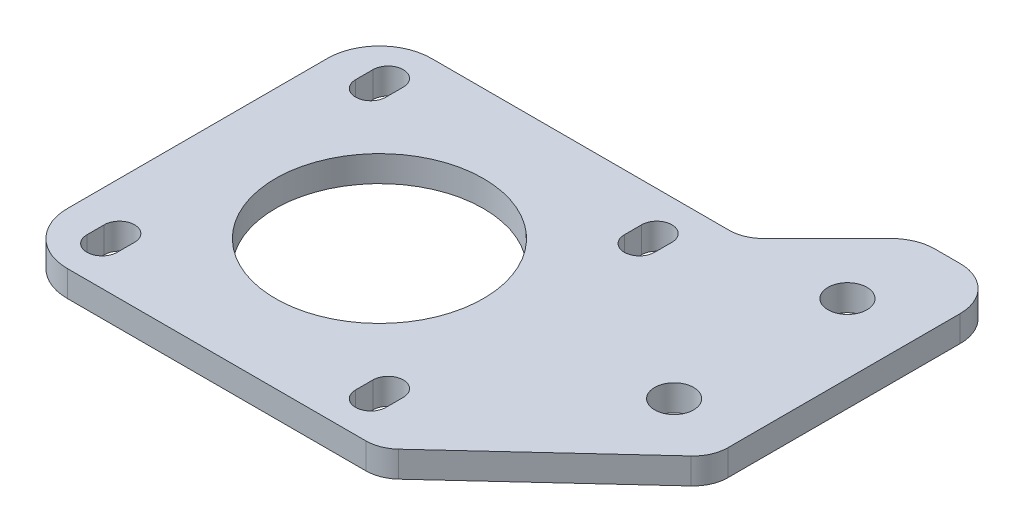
ISO-10303-21;
HEADER;
FILE_DESCRIPTION(('STEP AP214'),'2;1');
FILE_NAME('part.step','',(''),(''),'','','');
FILE_SCHEMA(('AUTOMOTIVE_DESIGN { 1 0 10303 214 1 1 1 1 }'));
ENDSEC;
DATA;
#1=APPLICATION_CONTEXT('core data for automotive mechanical design processes');
#2=APPLICATION_PROTOCOL_DEFINITION('international standard','automotive_design',2000,#1);
#3=PRODUCT_CONTEXT('',#1,'mechanical');
#4=PRODUCT('Part','Part','',(#3));
#5=PRODUCT_RELATED_PRODUCT_CATEGORY('part','',(#4));
#6=PRODUCT_DEFINITION_FORMATION('','',#4);
#7=PRODUCT_DEFINITION_CONTEXT('part definition',#1,'design');
#8=PRODUCT_DEFINITION('design','',#6,#7);
#9=PRODUCT_DEFINITION_SHAPE('','',#8);
#10=(LENGTH_UNIT() NAMED_UNIT(*) SI_UNIT(.MILLI.,.METRE.));
#11=(NAMED_UNIT(*) PLANE_ANGLE_UNIT() SI_UNIT($,.RADIAN.));
#12=(NAMED_UNIT(*) SI_UNIT($,.STERADIAN.) SOLID_ANGLE_UNIT());
#13=UNCERTAINTY_MEASURE_WITH_UNIT(LENGTH_MEASURE(1.E-05),#10,'distance_accuracy_value','');
#14=(GEOMETRIC_REPRESENTATION_CONTEXT(3) GLOBAL_UNCERTAINTY_ASSIGNED_CONTEXT((#13)) GLOBAL_UNIT_ASSIGNED_CONTEXT((#10,
#11,#12)) REPRESENTATION_CONTEXT('',''));
#15=CARTESIAN_POINT('',(0.,0.,0.));
#16=DIRECTION('',(0.,0.,1.));
#17=DIRECTION('',(1.,0.,0.));
#18=AXIS2_PLACEMENT_3D('',#15,#16,#17);
#19=CARTESIAN_POINT('',(-15.0000000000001,1.5,15.));
#20=DIRECTION('',(0.,1.,0.));
#21=DIRECTION('',(0.,0.,1.));
#22=AXIS2_PLACEMENT_3D('',#19,#20,#21);
#23=PLANE('',#22);
#24=CARTESIAN_POINT('',(33.,1.5,-0.999999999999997));
#25=DIRECTION('',(0.,1.,0.));
#26=DIRECTION('',(0.,0.,-1.));
#27=AXIS2_PLACEMENT_3D('',#24,#25,#26);
#28=CIRCLE('',#27,2.25);
#29=CARTESIAN_POINT('',(33.,1.5,-3.25));
#30=VERTEX_POINT('',#29);
#31=EDGE_CURVE('E927',#30,#30,#28,.T.);
#32=ORIENTED_EDGE('',*,*,#31,.F.);
#33=EDGE_LOOP('',(#32));
#34=FACE_BOUND('',#33,.T.);
#35=DIRECTION('',(0.,0.,-1.));
#36=VECTOR('',#35,1.);
#37=CARTESIAN_POINT('',(-13.75,1.5,-16.5000000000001));
#38=LINE('',#37,#36);
#39=CARTESIAN_POINT('',(-13.75,1.5,-14.5));
#40=VERTEX_POINT('',#39);
#41=CARTESIAN_POINT('',(-13.75,1.5,-16.5000000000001));
#42=VERTEX_POINT('',#41);
#43=EDGE_CURVE('E242',#40,#42,#38,.T.);
#44=ORIENTED_EDGE('',*,*,#43,.F.);
#45=CARTESIAN_POINT('',(-15.5000000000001,1.5,-14.5));
#46=DIRECTION('',(0.,1.,0.));
#47=DIRECTION('',(0.,0.,-1.));
#48=AXIS2_PLACEMENT_3D('',#45,#46,#47);
#49=CIRCLE('',#48,1.75000000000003);
#50=CARTESIAN_POINT('',(-17.25,1.5,-14.5));
#51=VERTEX_POINT('',#50);
#52=EDGE_CURVE('E234',#51,#40,#49,.T.);
#53=ORIENTED_EDGE('',*,*,#52,.F.);
#54=DIRECTION('',(0.,0.,1.));
#55=VECTOR('',#54,1.);
#56=CARTESIAN_POINT('',(-17.25,1.5,-14.5));
#57=LINE('',#56,#55);
#58=CARTESIAN_POINT('',(-17.25,1.5,-16.5));
#59=VERTEX_POINT('',#58);
#60=EDGE_CURVE('E257',#59,#51,#57,.T.);
#61=ORIENTED_EDGE('',*,*,#60,.F.);
#62=CARTESIAN_POINT('',(-15.5000000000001,1.5,-16.5000000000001));
#63=DIRECTION('',(0.,1.,0.));
#64=DIRECTION('',(0.,0.,-1.));
#65=AXIS2_PLACEMENT_3D('',#62,#63,#64);
#66=CIRCLE('',#65,1.75);
#67=EDGE_CURVE('E255',#42,#59,#66,.T.);
#68=ORIENTED_EDGE('',*,*,#67,.F.);
#69=EDGE_LOOP('',(#44,#53,#61,#68));
#70=FACE_BOUND('',#69,.T.);
#71=DIRECTION('',(0.,0.,-1.));
#72=VECTOR('',#71,1.);
#73=CARTESIAN_POINT('',(17.25,1.5,-16.5000000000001));
#74=LINE('',#73,#72);
#75=CARTESIAN_POINT('',(17.25,1.5,-14.5));
#76=VERTEX_POINT('',#75);
#77=CARTESIAN_POINT('',(17.25,1.5,-16.5000000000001));
#78=VERTEX_POINT('',#77);
#79=EDGE_CURVE('E275',#76,#78,#74,.T.);
#80=ORIENTED_EDGE('',*,*,#79,.F.);
#81=CARTESIAN_POINT('',(15.5,1.5,-14.5));
#82=DIRECTION('',(0.,1.,0.));
#83=DIRECTION('',(0.,0.,-1.));
#84=AXIS2_PLACEMENT_3D('',#81,#82,#83);
#85=CIRCLE('',#84,1.75);
#86=CARTESIAN_POINT('',(13.75,1.5,-14.5));
#87=VERTEX_POINT('',#86);
#88=EDGE_CURVE('E273',#87,#76,#85,.T.);
#89=ORIENTED_EDGE('',*,*,#88,.F.);
#90=DIRECTION('',(0.,0.,1.));
#91=VECTOR('',#90,1.);
#92=CARTESIAN_POINT('',(13.75,1.5,-14.5));
#93=LINE('',#92,#91);
#94=CARTESIAN_POINT('',(13.75,1.5,-16.5000000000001));
#95=VERTEX_POINT('',#94);
#96=EDGE_CURVE('E281',#95,#87,#93,.T.);
#97=ORIENTED_EDGE('',*,*,#96,.F.);
#98=CARTESIAN_POINT('',(15.5,1.5,-16.5000000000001));
#99=DIRECTION('',(0.,1.,0.));
#100=DIRECTION('',(0.,0.,-1.));
#101=AXIS2_PLACEMENT_3D('',#98,#99,#100);
#102=CIRCLE('',#101,1.75);
#103=EDGE_CURVE('E278',#78,#95,#102,.T.);
#104=ORIENTED_EDGE('',*,*,#103,.F.);
#105=EDGE_LOOP('',(#80,#89,#97,#104));
#106=FACE_BOUND('',#105,.T.);
#107=DIRECTION('',(0.,0.,1.));
#108=VECTOR('',#107,1.);
#109=CARTESIAN_POINT('',(-17.25,1.5,16.5));
#110=LINE('',#109,#108);
#111=CARTESIAN_POINT('',(-17.25,1.5,14.5));
#112=VERTEX_POINT('',#111);
#113=CARTESIAN_POINT('',(-17.2500000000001,1.5,16.5));
#114=VERTEX_POINT('',#113);
#115=EDGE_CURVE('E306',#112,#114,#110,.T.);
#116=ORIENTED_EDGE('',*,*,#115,.F.);
#117=CARTESIAN_POINT('',(-15.5000000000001,1.5,14.5));
#118=DIRECTION('',(0.,1.,0.));
#119=DIRECTION('',(0.,0.,-1.));
#120=AXIS2_PLACEMENT_3D('',#117,#118,#119);
#121=CIRCLE('',#120,1.75);
#122=CARTESIAN_POINT('',(-13.75,1.5,14.5));
#123=VERTEX_POINT('',#122);
#124=EDGE_CURVE('E304',#123,#112,#121,.T.);
#125=ORIENTED_EDGE('',*,*,#124,.F.);
#126=DIRECTION('',(0.,0.,-1.));
#127=VECTOR('',#126,1.);
#128=CARTESIAN_POINT('',(-13.75,1.5,14.5));
#129=LINE('',#128,#127);
#130=CARTESIAN_POINT('',(-13.75,1.5,16.5));
#131=VERTEX_POINT('',#130);
#132=EDGE_CURVE('E312',#131,#123,#129,.T.);
#133=ORIENTED_EDGE('',*,*,#132,.F.);
#134=CARTESIAN_POINT('',(-15.5000000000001,1.5,16.5));
#135=DIRECTION('',(0.,1.,0.));
#136=DIRECTION('',(0.,0.,-1.));
#137=AXIS2_PLACEMENT_3D('',#134,#135,#136);
#138=CIRCLE('',#137,1.75000000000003);
#139=EDGE_CURVE('E309',#114,#131,#138,.T.);
#140=ORIENTED_EDGE('',*,*,#139,.F.);
#141=EDGE_LOOP('',(#116,#125,#133,#140));
#142=FACE_BOUND('',#141,.T.);
#143=DIRECTION('',(0.,0.,1.));
#144=VECTOR('',#143,1.);
#145=CARTESIAN_POINT('',(13.75,1.5,16.5));
#146=LINE('',#145,#144);
#147=CARTESIAN_POINT('',(13.75,1.5,14.5));
#148=VERTEX_POINT('',#147);
#149=CARTESIAN_POINT('',(13.75,1.5,16.5));
#150=VERTEX_POINT('',#149);
#151=EDGE_CURVE('E337',#148,#150,#146,.T.);
#152=ORIENTED_EDGE('',*,*,#151,.F.);
#153=CARTESIAN_POINT('',(15.5,1.5,14.5));
#154=DIRECTION('',(0.,1.,0.));
#155=DIRECTION('',(0.,0.,-1.));
#156=AXIS2_PLACEMENT_3D('',#153,#154,#155);
#157=CIRCLE('',#156,1.75);
#158=CARTESIAN_POINT('',(17.25,1.5,14.5));
#159=VERTEX_POINT('',#158);
#160=EDGE_CURVE('E335',#159,#148,#157,.T.);
#161=ORIENTED_EDGE('',*,*,#160,.F.);
#162=DIRECTION('',(0.,0.,-1.));
#163=VECTOR('',#162,1.);
#164=CARTESIAN_POINT('',(17.25,1.5,14.5));
#165=LINE('',#164,#163);
#166=CARTESIAN_POINT('',(17.25,1.5,16.5));
#167=VERTEX_POINT('',#166);
#168=EDGE_CURVE('E343',#167,#159,#165,.T.);
#169=ORIENTED_EDGE('',*,*,#168,.F.);
#170=CARTESIAN_POINT('',(15.5,1.5,16.5));
#171=DIRECTION('',(0.,1.,0.));
#172=DIRECTION('',(0.,0.,-1.));
#173=AXIS2_PLACEMENT_3D('',#170,#171,#172);
#174=CIRCLE('',#173,1.75);
#175=EDGE_CURVE('E340',#150,#167,#174,.T.);
#176=ORIENTED_EDGE('',*,*,#175,.F.);
#177=EDGE_LOOP('',(#152,#161,#169,#176));
#178=FACE_BOUND('',#177,.T.);
#179=CARTESIAN_POINT('',(-15.0000000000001,1.5,15.));
#180=DIRECTION('',(0.,1.,0.));
#181=DIRECTION('',(0.,0.,1.));
#182=AXIS2_PLACEMENT_3D('',#179,#180,#181);
#183=CIRCLE('',#182,5.99999999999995);
#184=CARTESIAN_POINT('',(-21.,1.5,15.));
#185=VERTEX_POINT('',#184);
#186=CARTESIAN_POINT('',(-15.0000000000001,1.5,21.));
#187=VERTEX_POINT('',#186);
#188=EDGE_CURVE('E366',#185,#187,#183,.T.);
#189=ORIENTED_EDGE('',*,*,#188,.T.);
#190=DIRECTION('',(1.,0.,0.));
#191=VECTOR('',#190,1.);
#192=CARTESIAN_POINT('',(-15.0000000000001,1.5,21.));
#193=LINE('',#192,#191);
#194=CARTESIAN_POINT('',(19.4367830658,1.5,21.));
#195=VERTEX_POINT('',#194);
#196=EDGE_CURVE('E369',#187,#195,#193,.T.);
#197=ORIENTED_EDGE('',*,*,#196,.T.);
#198=CARTESIAN_POINT('',(19.4367830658,1.5,16.9999999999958));
#199=DIRECTION('',(0.,1.,0.));
#200=DIRECTION('',(0.,0.,1.));
#201=AXIS2_PLACEMENT_3D('',#198,#199,#200);
#202=CIRCLE('',#201,4.00000000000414);
#203=CARTESIAN_POINT('',(22.1489875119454,1.5,19.9400590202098));
#204=VERTEX_POINT('',#203);
#205=EDGE_CURVE('E372',#195,#204,#202,.T.);
#206=ORIENTED_EDGE('',*,*,#205,.T.);
#207=DIRECTION('',(0.735014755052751,0.,-0.678051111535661));
#208=VECTOR('',#207,1.);
#209=CARTESIAN_POINT('',(22.1489875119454,1.5,19.9400590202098));
#210=LINE('',#209,#208);
#211=CARTESIAN_POINT('',(39.7122044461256,1.5,3.73799139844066));
#212=VERTEX_POINT('',#211);
#213=EDGE_CURVE('E374',#204,#212,#210,.T.);
#214=ORIENTED_EDGE('',*,*,#213,.T.);
#215=CARTESIAN_POINT('',(36.999999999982,1.5,0.797932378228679));
#216=DIRECTION('',(0.,1.,0.));
#217=DIRECTION('',(0.,0.,1.));
#218=AXIS2_PLACEMENT_3D('',#215,#216,#217);
#219=CIRCLE('',#218,4.00000000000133);
#220=CARTESIAN_POINT('',(40.9999999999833,1.5,0.797932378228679));
#221=VERTEX_POINT('',#220);
#222=EDGE_CURVE('E376',#212,#221,#219,.T.);
#223=ORIENTED_EDGE('',*,*,#222,.T.);
#224=DIRECTION('',(0.,0.,-1.));
#225=VECTOR('',#224,1.);
#226=CARTESIAN_POINT('',(40.9999999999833,1.5,0.797932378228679));
#227=LINE('',#226,#225);
#228=CARTESIAN_POINT('',(40.9999999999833,1.5,-26.0000000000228));
#229=VERTEX_POINT('',#228);
#230=EDGE_CURVE('E378',#221,#229,#227,.T.);
#231=ORIENTED_EDGE('',*,*,#230,.T.);
#232=CARTESIAN_POINT('',(35.9999999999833,1.5,-26.0000000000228));
#233=DIRECTION('',(0.,1.,0.));
#234=DIRECTION('',(0.,0.,1.));
#235=AXIS2_PLACEMENT_3D('',#232,#233,#234);
#236=CIRCLE('',#235,5.);
#237=CARTESIAN_POINT('',(35.9999999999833,1.5,-31.0000000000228));
#238=VERTEX_POINT('',#237);
#239=EDGE_CURVE('E380',#229,#238,#236,.T.);
#240=ORIENTED_EDGE('',*,*,#239,.T.);
#241=DIRECTION('',(-1.,0.,0.));
#242=VECTOR('',#241,1.);
#243=CARTESIAN_POINT('',(35.9999999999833,1.5,-31.0000000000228));
#244=LINE('',#243,#242);
#245=CARTESIAN_POINT('',(33.0710678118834,1.5,-31.0000000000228));
#246=VERTEX_POINT('',#245);
#247=EDGE_CURVE('E382',#238,#246,#244,.T.);
#248=ORIENTED_EDGE('',*,*,#247,.T.);
#249=CARTESIAN_POINT('',(33.0710678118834,1.5,-26.0000000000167));
#250=DIRECTION('',(0.,1.,0.));
#251=DIRECTION('',(0.,0.,1.));
#252=AXIS2_PLACEMENT_3D('',#249,#250,#251);
#253=CIRCLE('',#252,5.00000000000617);
#254=CARTESIAN_POINT('',(29.5355339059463,1.5,-29.5355339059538));
#255=VERTEX_POINT('',#254);
#256=EDGE_CURVE('E384',#246,#255,#253,.T.);
#257=ORIENTED_EDGE('',*,*,#256,.T.);
#258=DIRECTION('',(-0.707106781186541,0.,0.707106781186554));
#259=VECTOR('',#258,1.);
#260=CARTESIAN_POINT('',(29.5355339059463,1.5,-29.5355339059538));
#261=LINE('',#260,#259);
#262=CARTESIAN_POINT('',(22.1715728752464,1.5,-22.1715728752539));
#263=VERTEX_POINT('',#262);
#264=EDGE_CURVE('E386',#255,#263,#261,.T.);
#265=ORIENTED_EDGE('',*,*,#264,.T.);
#266=CARTESIAN_POINT('',(19.3431457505,1.5,-25.));
#267=DIRECTION('',(0.,-1.,0.));
#268=DIRECTION('',(0.,0.,-1.));
#269=AXIS2_PLACEMENT_3D('',#266,#267,#268);
#270=CIRCLE('',#269,4.00000000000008);
#271=CARTESIAN_POINT('',(19.3431457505,1.5,-21.));
#272=VERTEX_POINT('',#271);
#273=EDGE_CURVE('E388',#263,#272,#270,.T.);
#274=ORIENTED_EDGE('',*,*,#273,.T.);
#275=DIRECTION('',(-1.,0.,0.));
#276=VECTOR('',#275,1.);
#277=CARTESIAN_POINT('',(19.3431457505,1.5,-21.));
#278=LINE('',#277,#276);
#279=CARTESIAN_POINT('',(-15.0000000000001,1.5,-20.9999999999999));
#280=VERTEX_POINT('',#279);
#281=EDGE_CURVE('E390',#272,#280,#278,.T.);
#282=ORIENTED_EDGE('',*,*,#281,.T.);
#283=CARTESIAN_POINT('',(-15.0000000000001,1.5,-14.9999999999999));
#284=DIRECTION('',(0.,1.,0.));
#285=DIRECTION('',(0.,0.,1.));
#286=AXIS2_PLACEMENT_3D('',#283,#284,#285);
#287=CIRCLE('',#286,6.);
#288=CARTESIAN_POINT('',(-21.,1.5,-15.));
#289=VERTEX_POINT('',#288);
#290=EDGE_CURVE('E392',#280,#289,#287,.T.);
#291=ORIENTED_EDGE('',*,*,#290,.T.);
#292=DIRECTION('',(0.,0.,1.));
#293=VECTOR('',#292,1.);
#294=CARTESIAN_POINT('',(-21.,1.5,-15.));
#295=LINE('',#294,#293);
#296=EDGE_CURVE('E394',#289,#185,#295,.T.);
#297=ORIENTED_EDGE('',*,*,#296,.T.);
#298=EDGE_LOOP('',(#189,#197,#206,#214,#223,#231,#240,#248,#257,#265,#274,#282,#291,#297));
#299=FACE_BOUND('',#298,.T.);
#300=CARTESIAN_POINT('',(0.,1.5,0.));
#301=DIRECTION('',(0.,1.,0.));
#302=DIRECTION('',(0.,0.,-1.));
#303=AXIS2_PLACEMENT_3D('',#300,#301,#302);
#304=CIRCLE('',#303,12.);
#305=CARTESIAN_POINT('',(0.,1.5,-12.));
#306=VERTEX_POINT('',#305);
#307=EDGE_CURVE('E263',#306,#306,#304,.T.);
#308=ORIENTED_EDGE('',*,*,#307,.F.);
#309=EDGE_LOOP('',(#308));
#310=FACE_BOUND('',#309,.T.);
#311=CARTESIAN_POINT('',(33.,1.5,-21.));
#312=DIRECTION('',(0.,1.,0.));
#313=DIRECTION('',(0.,0.,-1.));
#314=AXIS2_PLACEMENT_3D('',#311,#312,#313);
#315=CIRCLE('',#314,2.25);
#316=CARTESIAN_POINT('',(33.,1.5,-23.25));
#317=VERTEX_POINT('',#316);
#318=EDGE_CURVE('E918',#317,#317,#315,.T.);
#319=ORIENTED_EDGE('',*,*,#318,.F.);
#320=EDGE_LOOP('',(#319));
#321=FACE_BOUND('',#320,.T.);
#322=ADVANCED_FACE('F37',(#34,#70,#106,#142,#178,#299,#310,#321),#23,.T.);
#323=CARTESIAN_POINT('',(-15.0000000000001,-1.5,15.));
#324=DIRECTION('',(0.,1.,0.));
#325=DIRECTION('',(0.,0.,1.));
#326=AXIS2_PLACEMENT_3D('',#323,#324,#325);
#327=PLANE('',#326);
#328=CARTESIAN_POINT('',(15.5,-1.5,-14.5));
#329=DIRECTION('',(0.,1.,0.));
#330=DIRECTION('',(0.,0.,-1.));
#331=AXIS2_PLACEMENT_3D('',#328,#329,#330);
#332=CIRCLE('',#331,1.75);
#333=CARTESIAN_POINT('',(13.75,-1.5,-14.5));
#334=VERTEX_POINT('',#333);
#335=CARTESIAN_POINT('',(17.25,-1.5,-14.5));
#336=VERTEX_POINT('',#335);
#337=EDGE_CURVE('E250',#334,#336,#332,.T.);
#338=ORIENTED_EDGE('',*,*,#337,.T.);
#339=DIRECTION('',(0.,0.,-1.));
#340=VECTOR('',#339,1.);
#341=CARTESIAN_POINT('',(17.25,-1.5,-16.5000000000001));
#342=LINE('',#341,#340);
#343=CARTESIAN_POINT('',(17.25,-1.5,-16.5000000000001));
#344=VERTEX_POINT('',#343);
#345=EDGE_CURVE('E286',#336,#344,#342,.T.);
#346=ORIENTED_EDGE('',*,*,#345,.T.);
#347=CARTESIAN_POINT('',(15.5,-1.5,-16.5000000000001));
#348=DIRECTION('',(0.,1.,0.));
#349=DIRECTION('',(0.,0.,-1.));
#350=AXIS2_PLACEMENT_3D('',#347,#348,#349);
#351=CIRCLE('',#350,1.75);
#352=CARTESIAN_POINT('',(13.75,-1.5,-16.5000000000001));
#353=VERTEX_POINT('',#352);
#354=EDGE_CURVE('E289',#344,#353,#351,.T.);
#355=ORIENTED_EDGE('',*,*,#354,.T.);
#356=DIRECTION('',(0.,0.,1.));
#357=VECTOR('',#356,1.);
#358=CARTESIAN_POINT('',(13.75,-1.5,-14.5));
#359=LINE('',#358,#357);
#360=EDGE_CURVE('E276',#353,#334,#359,.T.);
#361=ORIENTED_EDGE('',*,*,#360,.T.);
#362=EDGE_LOOP('',(#338,#346,#355,#361));
#363=FACE_BOUND('',#362,.T.);
#364=CARTESIAN_POINT('',(15.5,-1.5,14.5));
#365=DIRECTION('',(0.,1.,0.));
#366=DIRECTION('',(0.,0.,-1.));
#367=AXIS2_PLACEMENT_3D('',#364,#365,#366);
#368=CIRCLE('',#367,1.75);
#369=CARTESIAN_POINT('',(17.25,-1.5,14.5));
#370=VERTEX_POINT('',#369);
#371=CARTESIAN_POINT('',(13.75,-1.5,14.5));
#372=VERTEX_POINT('',#371);
#373=EDGE_CURVE('E334',#370,#372,#368,.T.);
#374=ORIENTED_EDGE('',*,*,#373,.T.);
#375=DIRECTION('',(0.,0.,1.));
#376=VECTOR('',#375,1.);
#377=CARTESIAN_POINT('',(13.75,-1.5,16.5));
#378=LINE('',#377,#376);
#379=CARTESIAN_POINT('',(13.75,-1.5,16.5));
#380=VERTEX_POINT('',#379);
#381=EDGE_CURVE('E348',#372,#380,#378,.T.);
#382=ORIENTED_EDGE('',*,*,#381,.T.);
#383=CARTESIAN_POINT('',(15.5,-1.5,16.5));
#384=DIRECTION('',(0.,1.,0.));
#385=DIRECTION('',(0.,0.,-1.));
#386=AXIS2_PLACEMENT_3D('',#383,#384,#385);
#387=CIRCLE('',#386,1.75);
#388=CARTESIAN_POINT('',(17.25,-1.5,16.5));
#389=VERTEX_POINT('',#388);
#390=EDGE_CURVE('E351',#380,#389,#387,.T.);
#391=ORIENTED_EDGE('',*,*,#390,.T.);
#392=DIRECTION('',(0.,0.,-1.));
#393=VECTOR('',#392,1.);
#394=CARTESIAN_POINT('',(17.25,-1.5,14.5));
#395=LINE('',#394,#393);
#396=EDGE_CURVE('E338',#389,#370,#395,.T.);
#397=ORIENTED_EDGE('',*,*,#396,.T.);
#398=EDGE_LOOP('',(#374,#382,#391,#397));
#399=FACE_BOUND('',#398,.T.);
#400=CARTESIAN_POINT('',(-15.0000000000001,-1.5,15.));
#401=DIRECTION('',(0.,1.,0.));
#402=DIRECTION('',(0.,0.,1.));
#403=AXIS2_PLACEMENT_3D('',#400,#401,#402);
#404=CIRCLE('',#403,5.99999999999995);
#405=CARTESIAN_POINT('',(-21.,-1.5,15.));
#406=VERTEX_POINT('',#405);
#407=CARTESIAN_POINT('',(-15.0000000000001,-1.5,21.));
#408=VERTEX_POINT('',#407);
#409=EDGE_CURVE('E365',#406,#408,#404,.T.);
#410=ORIENTED_EDGE('',*,*,#409,.F.);
#411=DIRECTION('',(0.,0.,1.));
#412=VECTOR('',#411,1.);
#413=CARTESIAN_POINT('',(-21.,-1.5,-15.));
#414=LINE('',#413,#412);
#415=CARTESIAN_POINT('',(-21.,-1.5,-15.));
#416=VERTEX_POINT('',#415);
#417=EDGE_CURVE('E370',#416,#406,#414,.T.);
#418=ORIENTED_EDGE('',*,*,#417,.F.);
#419=CARTESIAN_POINT('',(-15.0000000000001,-1.5,-14.9999999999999));
#420=DIRECTION('',(0.,1.,0.));
#421=DIRECTION('',(0.,0.,1.));
#422=AXIS2_PLACEMENT_3D('',#419,#420,#421);
#423=CIRCLE('',#422,6.);
#424=CARTESIAN_POINT('',(-15.0000000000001,-1.5,-20.9999999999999));
#425=VERTEX_POINT('',#424);
#426=EDGE_CURVE('E421',#425,#416,#423,.T.);
#427=ORIENTED_EDGE('',*,*,#426,.F.);
#428=DIRECTION('',(-1.,0.,0.));
#429=VECTOR('',#428,1.);
#430=CARTESIAN_POINT('',(19.3431457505,-1.5,-21.));
#431=LINE('',#430,#429);
#432=CARTESIAN_POINT('',(19.3431457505,-1.5,-21.));
#433=VERTEX_POINT('',#432);
#434=EDGE_CURVE('E419',#433,#425,#431,.T.);
#435=ORIENTED_EDGE('',*,*,#434,.F.);
#436=CARTESIAN_POINT('',(19.3431457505,-1.5,-25.));
#437=DIRECTION('',(0.,-1.,0.));
#438=DIRECTION('',(0.,0.,-1.));
#439=AXIS2_PLACEMENT_3D('',#436,#437,#438);
#440=CIRCLE('',#439,4.00000000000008);
#441=CARTESIAN_POINT('',(22.1715728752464,-1.5,-22.1715728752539));
#442=VERTEX_POINT('',#441);
#443=EDGE_CURVE('E417',#442,#433,#440,.T.);
#444=ORIENTED_EDGE('',*,*,#443,.F.);
#445=DIRECTION('',(-0.707106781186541,0.,0.707106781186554));
#446=VECTOR('',#445,1.);
#447=CARTESIAN_POINT('',(29.5355339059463,-1.5,-29.5355339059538));
#448=LINE('',#447,#446);
#449=CARTESIAN_POINT('',(29.5355339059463,-1.5,-29.5355339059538));
#450=VERTEX_POINT('',#449);
#451=EDGE_CURVE('E415',#450,#442,#448,.T.);
#452=ORIENTED_EDGE('',*,*,#451,.F.);
#453=CARTESIAN_POINT('',(33.0710678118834,-1.5,-26.0000000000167));
#454=DIRECTION('',(0.,1.,0.));
#455=DIRECTION('',(0.,0.,1.));
#456=AXIS2_PLACEMENT_3D('',#453,#454,#455);
#457=CIRCLE('',#456,5.00000000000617);
#458=CARTESIAN_POINT('',(33.0710678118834,-1.5,-31.0000000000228));
#459=VERTEX_POINT('',#458);
#460=EDGE_CURVE('E413',#459,#450,#457,.T.);
#461=ORIENTED_EDGE('',*,*,#460,.F.);
#462=DIRECTION('',(-1.,0.,0.));
#463=VECTOR('',#462,1.);
#464=CARTESIAN_POINT('',(35.9999999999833,-1.5,-31.0000000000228));
#465=LINE('',#464,#463);
#466=CARTESIAN_POINT('',(35.9999999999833,-1.5,-31.0000000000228));
#467=VERTEX_POINT('',#466);
#468=EDGE_CURVE('E411',#467,#459,#465,.T.);
#469=ORIENTED_EDGE('',*,*,#468,.F.);
#470=CARTESIAN_POINT('',(35.9999999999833,-1.5,-26.0000000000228));
#471=DIRECTION('',(0.,1.,0.));
#472=DIRECTION('',(0.,0.,1.));
#473=AXIS2_PLACEMENT_3D('',#470,#471,#472);
#474=CIRCLE('',#473,5.);
#475=CARTESIAN_POINT('',(40.9999999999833,-1.5,-26.0000000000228));
#476=VERTEX_POINT('',#475);
#477=EDGE_CURVE('E409',#476,#467,#474,.T.);
#478=ORIENTED_EDGE('',*,*,#477,.F.);
#479=DIRECTION('',(0.,0.,-1.));
#480=VECTOR('',#479,1.);
#481=CARTESIAN_POINT('',(40.9999999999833,-1.5,0.797932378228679));
#482=LINE('',#481,#480);
#483=CARTESIAN_POINT('',(40.9999999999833,-1.5,0.797932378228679));
#484=VERTEX_POINT('',#483);
#485=EDGE_CURVE('E407',#484,#476,#482,.T.);
#486=ORIENTED_EDGE('',*,*,#485,.F.);
#487=CARTESIAN_POINT('',(36.999999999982,-1.5,0.797932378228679));
#488=DIRECTION('',(0.,1.,0.));
#489=DIRECTION('',(0.,0.,1.));
#490=AXIS2_PLACEMENT_3D('',#487,#488,#489);
#491=CIRCLE('',#490,4.00000000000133);
#492=CARTESIAN_POINT('',(39.7122044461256,-1.5,3.73799139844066));
#493=VERTEX_POINT('',#492);
#494=EDGE_CURVE('E405',#493,#484,#491,.T.);
#495=ORIENTED_EDGE('',*,*,#494,.F.);
#496=DIRECTION('',(0.735014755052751,0.,-0.678051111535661));
#497=VECTOR('',#496,1.);
#498=CARTESIAN_POINT('',(22.1489875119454,-1.5,19.9400590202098));
#499=LINE('',#498,#497);
#500=CARTESIAN_POINT('',(22.1489875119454,-1.5,19.9400590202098));
#501=VERTEX_POINT('',#500);
#502=EDGE_CURVE('E403',#501,#493,#499,.T.);
#503=ORIENTED_EDGE('',*,*,#502,.F.);
#504=CARTESIAN_POINT('',(19.4367830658,-1.5,16.9999999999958));
#505=DIRECTION('',(0.,1.,0.));
#506=DIRECTION('',(0.,0.,1.));
#507=AXIS2_PLACEMENT_3D('',#504,#505,#506);
#508=CIRCLE('',#507,4.00000000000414);
#509=CARTESIAN_POINT('',(19.4367830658,-1.5,21.));
#510=VERTEX_POINT('',#509);
#511=EDGE_CURVE('E401',#510,#501,#508,.T.);
#512=ORIENTED_EDGE('',*,*,#511,.F.);
#513=DIRECTION('',(1.,0.,0.));
#514=VECTOR('',#513,1.);
#515=CARTESIAN_POINT('',(-15.0000000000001,-1.5,21.));
#516=LINE('',#515,#514);
#517=EDGE_CURVE('E399',#408,#510,#516,.T.);
#518=ORIENTED_EDGE('',*,*,#517,.F.);
#519=EDGE_LOOP('',(#410,#418,#427,#435,#444,#452,#461,#469,#478,#486,#495,#503,#512,#518));
#520=FACE_BOUND('',#519,.T.);
#521=CARTESIAN_POINT('',(-15.5000000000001,-1.5,14.5));
#522=DIRECTION('',(0.,1.,0.));
#523=DIRECTION('',(0.,0.,-1.));
#524=AXIS2_PLACEMENT_3D('',#521,#522,#523);
#525=CIRCLE('',#524,1.75);
#526=CARTESIAN_POINT('',(-13.75,-1.5,14.5));
#527=VERTEX_POINT('',#526);
#528=CARTESIAN_POINT('',(-17.25,-1.5,14.5));
#529=VERTEX_POINT('',#528);
#530=EDGE_CURVE('E303',#527,#529,#525,.T.);
#531=ORIENTED_EDGE('',*,*,#530,.T.);
#532=DIRECTION('',(0.,0.,1.));
#533=VECTOR('',#532,1.);
#534=CARTESIAN_POINT('',(-17.25,-1.5,16.5));
#535=LINE('',#534,#533);
#536=CARTESIAN_POINT('',(-17.2500000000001,-1.5,16.5));
#537=VERTEX_POINT('',#536);
#538=EDGE_CURVE('E317',#529,#537,#535,.T.);
#539=ORIENTED_EDGE('',*,*,#538,.T.);
#540=CARTESIAN_POINT('',(-15.5000000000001,-1.5,16.5));
#541=DIRECTION('',(0.,1.,0.));
#542=DIRECTION('',(0.,0.,-1.));
#543=AXIS2_PLACEMENT_3D('',#540,#541,#542);
#544=CIRCLE('',#543,1.75000000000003);
#545=CARTESIAN_POINT('',(-13.75,-1.5,16.5));
#546=VERTEX_POINT('',#545);
#547=EDGE_CURVE('E320',#537,#546,#544,.T.);
#548=ORIENTED_EDGE('',*,*,#547,.T.);
#549=DIRECTION('',(0.,0.,-1.));
#550=VECTOR('',#549,1.);
#551=CARTESIAN_POINT('',(-13.75,-1.5,14.5));
#552=LINE('',#551,#550);
#553=EDGE_CURVE('E307',#546,#527,#552,.T.);
#554=ORIENTED_EDGE('',*,*,#553,.T.);
#555=EDGE_LOOP('',(#531,#539,#548,#554));
#556=FACE_BOUND('',#555,.T.);
#557=CARTESIAN_POINT('',(-15.5000000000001,-1.5,-14.5));
#558=DIRECTION('',(0.,1.,0.));
#559=DIRECTION('',(0.,0.,-1.));
#560=AXIS2_PLACEMENT_3D('',#557,#558,#559);
#561=CIRCLE('',#560,1.75000000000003);
#562=CARTESIAN_POINT('',(-17.25,-1.5,-14.5));
#563=VERTEX_POINT('',#562);
#564=CARTESIAN_POINT('',(-13.75,-1.5,-14.5));
#565=VERTEX_POINT('',#564);
#566=EDGE_CURVE('E60',#563,#565,#561,.T.);
#567=ORIENTED_EDGE('',*,*,#566,.T.);
#568=DIRECTION('',(0.,0.,-1.));
#569=VECTOR('',#568,1.);
#570=CARTESIAN_POINT('',(-13.75,-1.5,-16.5000000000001));
#571=LINE('',#570,#569);
#572=CARTESIAN_POINT('',(-13.75,-1.5,-16.5000000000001));
#573=VERTEX_POINT('',#572);
#574=EDGE_CURVE('E249',#565,#573,#571,.T.);
#575=ORIENTED_EDGE('',*,*,#574,.T.);
#576=CARTESIAN_POINT('',(-15.5000000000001,-1.5,-16.5000000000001));
#577=DIRECTION('',(0.,1.,0.));
#578=DIRECTION('',(0.,0.,-1.));
#579=AXIS2_PLACEMENT_3D('',#576,#577,#578);
#580=CIRCLE('',#579,1.75);
#581=CARTESIAN_POINT('',(-17.2500000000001,-1.5,-16.5000000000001));
#582=VERTEX_POINT('',#581);
#583=EDGE_CURVE('E265',#573,#582,#580,.T.);
#584=ORIENTED_EDGE('',*,*,#583,.T.);
#585=DIRECTION('',(0.,0.,1.));
#586=VECTOR('',#585,1.);
#587=CARTESIAN_POINT('',(-17.25,-1.5,-14.5));
#588=LINE('',#587,#586);
#589=EDGE_CURVE('E243',#582,#563,#588,.T.);
#590=ORIENTED_EDGE('',*,*,#589,.T.);
#591=EDGE_LOOP('',(#567,#575,#584,#590));
#592=FACE_BOUND('',#591,.T.);
#593=CARTESIAN_POINT('',(0.,-1.5,0.));
#594=DIRECTION('',(0.,1.,0.));
#595=DIRECTION('',(0.,0.,-1.));
#596=AXIS2_PLACEMENT_3D('',#593,#594,#595);
#597=CIRCLE('',#596,12.);
#598=CARTESIAN_POINT('',(0.,-1.5,-12.));
#599=VERTEX_POINT('',#598);
#600=EDGE_CURVE('E930',#599,#599,#597,.T.);
#601=ORIENTED_EDGE('',*,*,#600,.T.);
#602=EDGE_LOOP('',(#601));
#603=FACE_BOUND('',#602,.T.);
#604=CARTESIAN_POINT('',(33.,-1.5,-0.999999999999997));
#605=DIRECTION('',(0.,1.,0.));
#606=DIRECTION('',(0.,0.,-1.));
#607=AXIS2_PLACEMENT_3D('',#604,#605,#606);
#608=CIRCLE('',#607,2.25);
#609=CARTESIAN_POINT('',(33.,-1.5,-3.25));
#610=VERTEX_POINT('',#609);
#611=EDGE_CURVE('E924',#610,#610,#608,.T.);
#612=ORIENTED_EDGE('',*,*,#611,.T.);
#613=EDGE_LOOP('',(#612));
#614=FACE_BOUND('',#613,.T.);
#615=CARTESIAN_POINT('',(33.,-1.5,-21.));
#616=DIRECTION('',(0.,1.,0.));
#617=DIRECTION('',(0.,0.,-1.));
#618=AXIS2_PLACEMENT_3D('',#615,#616,#617);
#619=CIRCLE('',#618,2.25);
#620=CARTESIAN_POINT('',(33.,-1.5,-23.25));
#621=VERTEX_POINT('',#620);
#622=EDGE_CURVE('E921',#621,#621,#619,.T.);
#623=ORIENTED_EDGE('',*,*,#622,.T.);
#624=EDGE_LOOP('',(#623));
#625=FACE_BOUND('',#624,.T.);
#626=ADVANCED_FACE('F469',(#363,#399,#520,#556,#592,#603,#614,#625),#327,.F.);
#627=CARTESIAN_POINT('',(-15.0000000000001,1.5,15.));
#628=DIRECTION('',(0.,-1.,0.));
#629=DIRECTION('',(0.,0.,-1.));
#630=AXIS2_PLACEMENT_3D('',#627,#628,#629);
#631=CYLINDRICAL_SURFACE('',#630,5.99999999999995);
#632=ORIENTED_EDGE('',*,*,#409,.T.);
#633=DIRECTION('',(0.,-1.,0.));
#634=VECTOR('',#633,1.);
#635=CARTESIAN_POINT('',(-15.0000000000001,1.5,21.));
#636=LINE('',#635,#634);
#637=EDGE_CURVE('E11',#187,#408,#636,.T.);
#638=ORIENTED_EDGE('',*,*,#637,.F.);
#639=ORIENTED_EDGE('',*,*,#188,.F.);
#640=DIRECTION('',(0.,-1.,0.));
#641=VECTOR('',#640,1.);
#642=CARTESIAN_POINT('',(-21.,1.5,15.));
#643=LINE('',#642,#641);
#644=EDGE_CURVE('E396',#185,#406,#643,.T.);
#645=ORIENTED_EDGE('',*,*,#644,.T.);
#646=EDGE_LOOP('',(#632,#638,#639,#645));
#647=FACE_BOUND('',#646,.T.);
#648=ADVANCED_FACE('F39',(#647),#631,.T.);
#649=CARTESIAN_POINT('',(-15.0000000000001,1.5,21.));
#650=DIRECTION('',(0.,0.,-1.));
#651=DIRECTION('',(-1.,0.,0.));
#652=AXIS2_PLACEMENT_3D('',#649,#650,#651);
#653=PLANE('',#652);
#654=ORIENTED_EDGE('',*,*,#517,.T.);
#655=DIRECTION('',(0.,-1.,0.));
#656=VECTOR('',#655,1.);
#657=CARTESIAN_POINT('',(19.4367830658,1.5,21.));
#658=LINE('',#657,#656);
#659=EDGE_CURVE('E45',#195,#510,#658,.T.);
#660=ORIENTED_EDGE('',*,*,#659,.F.);
#661=ORIENTED_EDGE('',*,*,#196,.F.);
#662=ORIENTED_EDGE('',*,*,#637,.T.);
#663=EDGE_LOOP('',(#654,#660,#661,#662));
#664=FACE_BOUND('',#663,.T.);
#665=ADVANCED_FACE('F487',(#664),#653,.F.);
#666=CARTESIAN_POINT('',(19.4367830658,1.5,16.9999999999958));
#667=DIRECTION('',(0.,-1.,0.));
#668=DIRECTION('',(0.,0.,-1.));
#669=AXIS2_PLACEMENT_3D('',#666,#667,#668);
#670=CYLINDRICAL_SURFACE('',#669,4.00000000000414);
#671=ORIENTED_EDGE('',*,*,#511,.T.);
#672=DIRECTION('',(0.,-1.,0.));
#673=VECTOR('',#672,1.);
#674=CARTESIAN_POINT('',(22.1489875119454,1.5,19.9400590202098));
#675=LINE('',#674,#673);
#676=EDGE_CURVE('E456',#204,#501,#675,.T.);
#677=ORIENTED_EDGE('',*,*,#676,.F.);
#678=ORIENTED_EDGE('',*,*,#205,.F.);
#679=ORIENTED_EDGE('',*,*,#659,.T.);
#680=EDGE_LOOP('',(#671,#677,#678,#679));
#681=FACE_BOUND('',#680,.T.);
#682=ADVANCED_FACE('F463',(#681),#670,.T.);
#683=CARTESIAN_POINT('',(22.1489875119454,1.5,19.9400590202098));
#684=DIRECTION('',(-0.678051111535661,0.,-0.735014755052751));
#685=DIRECTION('',(-0.735014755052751,0.,0.678051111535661));
#686=AXIS2_PLACEMENT_3D('',#683,#684,#685);
#687=PLANE('',#686);
#688=ORIENTED_EDGE('',*,*,#502,.T.);
#689=DIRECTION('',(0.,-1.,0.));
#690=VECTOR('',#689,1.);
#691=CARTESIAN_POINT('',(39.7122044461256,1.5,3.73799139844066));
#692=LINE('',#691,#690);
#693=EDGE_CURVE('E453',#212,#493,#692,.T.);
#694=ORIENTED_EDGE('',*,*,#693,.F.);
#695=ORIENTED_EDGE('',*,*,#213,.F.);
#696=ORIENTED_EDGE('',*,*,#676,.T.);
#697=EDGE_LOOP('',(#688,#694,#695,#696));
#698=FACE_BOUND('',#697,.T.);
#699=ADVANCED_FACE('F475',(#698),#687,.F.);
#700=CARTESIAN_POINT('',(36.999999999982,1.5,0.797932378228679));
#701=DIRECTION('',(0.,-1.,0.));
#702=DIRECTION('',(0.,0.,-1.));
#703=AXIS2_PLACEMENT_3D('',#700,#701,#702);
#704=CYLINDRICAL_SURFACE('',#703,4.00000000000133);
#705=ORIENTED_EDGE('',*,*,#494,.T.);
#706=DIRECTION('',(0.,-1.,0.));
#707=VECTOR('',#706,1.);
#708=CARTESIAN_POINT('',(40.9999999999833,1.5,0.797932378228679));
#709=LINE('',#708,#707);
#710=EDGE_CURVE('E450',#221,#484,#709,.T.);
#711=ORIENTED_EDGE('',*,*,#710,.F.);
#712=ORIENTED_EDGE('',*,*,#222,.F.);
#713=ORIENTED_EDGE('',*,*,#693,.T.);
#714=EDGE_LOOP('',(#705,#711,#712,#713));
#715=FACE_BOUND('',#714,.T.);
#716=ADVANCED_FACE('F479',(#715),#704,.T.);
#717=CARTESIAN_POINT('',(40.9999999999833,1.5,0.797932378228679));
#718=DIRECTION('',(-1.,0.,0.));
#719=DIRECTION('',(0.,0.,1.));
#720=AXIS2_PLACEMENT_3D('',#717,#718,#719);
#721=PLANE('',#720);
#722=ORIENTED_EDGE('',*,*,#485,.T.);
#723=DIRECTION('',(0.,-1.,0.));
#724=VECTOR('',#723,1.);
#725=CARTESIAN_POINT('',(40.9999999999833,1.5,-26.0000000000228));
#726=LINE('',#725,#724);
#727=EDGE_CURVE('E447',#229,#476,#726,.T.);
#728=ORIENTED_EDGE('',*,*,#727,.F.);
#729=ORIENTED_EDGE('',*,*,#230,.F.);
#730=ORIENTED_EDGE('',*,*,#710,.T.);
#731=EDGE_LOOP('',(#722,#728,#729,#730));
#732=FACE_BOUND('',#731,.T.);
#733=ADVANCED_FACE('F530',(#732),#721,.F.);
#734=CARTESIAN_POINT('',(35.9999999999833,1.5,-26.0000000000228));
#735=DIRECTION('',(0.,-1.,0.));
#736=DIRECTION('',(0.,0.,-1.));
#737=AXIS2_PLACEMENT_3D('',#734,#735,#736);
#738=CYLINDRICAL_SURFACE('',#737,5.);
#739=ORIENTED_EDGE('',*,*,#477,.T.);
#740=DIRECTION('',(0.,-1.,0.));
#741=VECTOR('',#740,1.);
#742=CARTESIAN_POINT('',(35.9999999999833,1.5,-31.0000000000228));
#743=LINE('',#742,#741);
#744=EDGE_CURVE('E444',#238,#467,#743,.T.);
#745=ORIENTED_EDGE('',*,*,#744,.F.);
#746=ORIENTED_EDGE('',*,*,#239,.F.);
#747=ORIENTED_EDGE('',*,*,#727,.T.);
#748=EDGE_LOOP('',(#739,#745,#746,#747));
#749=FACE_BOUND('',#748,.T.);
#750=ADVANCED_FACE('F528',(#749),#738,.T.);
#751=CARTESIAN_POINT('',(35.9999999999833,1.5,-31.0000000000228));
#752=DIRECTION('',(0.,0.,1.));
#753=DIRECTION('',(1.,0.,0.));
#754=AXIS2_PLACEMENT_3D('',#751,#752,#753);
#755=PLANE('',#754);
#756=ORIENTED_EDGE('',*,*,#468,.T.);
#757=DIRECTION('',(0.,-1.,0.));
#758=VECTOR('',#757,1.);
#759=CARTESIAN_POINT('',(33.0710678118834,1.5,-31.0000000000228));
#760=LINE('',#759,#758);
#761=EDGE_CURVE('E441',#246,#459,#760,.T.);
#762=ORIENTED_EDGE('',*,*,#761,.F.);
#763=ORIENTED_EDGE('',*,*,#247,.F.);
#764=ORIENTED_EDGE('',*,*,#744,.T.);
#765=EDGE_LOOP('',(#756,#762,#763,#764));
#766=FACE_BOUND('',#765,.T.);
#767=ADVANCED_FACE('F523',(#766),#755,.F.);
#768=CARTESIAN_POINT('',(33.0710678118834,1.5,-26.0000000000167));
#769=DIRECTION('',(0.,-1.,0.));
#770=DIRECTION('',(0.,0.,-1.));
#771=AXIS2_PLACEMENT_3D('',#768,#769,#770);
#772=CYLINDRICAL_SURFACE('',#771,5.00000000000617);
#773=ORIENTED_EDGE('',*,*,#460,.T.);
#774=DIRECTION('',(0.,-1.,0.));
#775=VECTOR('',#774,1.);
#776=CARTESIAN_POINT('',(29.5355339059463,1.5,-29.5355339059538));
#777=LINE('',#776,#775);
#778=EDGE_CURVE('E438',#255,#450,#777,.T.);
#779=ORIENTED_EDGE('',*,*,#778,.F.);
#780=ORIENTED_EDGE('',*,*,#256,.F.);
#781=ORIENTED_EDGE('',*,*,#761,.T.);
#782=EDGE_LOOP('',(#773,#779,#780,#781));
#783=FACE_BOUND('',#782,.T.);
#784=ADVANCED_FACE('F518',(#783),#772,.T.);
#785=CARTESIAN_POINT('',(29.5355339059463,1.5,-29.5355339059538));
#786=DIRECTION('',(0.707106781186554,0.,0.707106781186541));
#787=DIRECTION('',(0.707106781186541,0.,-0.707106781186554));
#788=AXIS2_PLACEMENT_3D('',#785,#786,#787);
#789=PLANE('',#788);
#790=ORIENTED_EDGE('',*,*,#451,.T.);
#791=DIRECTION('',(0.,-1.,0.));
#792=VECTOR('',#791,1.);
#793=CARTESIAN_POINT('',(22.1715728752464,1.5,-22.1715728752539));
#794=LINE('',#793,#792);
#795=EDGE_CURVE('E435',#263,#442,#794,.T.);
#796=ORIENTED_EDGE('',*,*,#795,.F.);
#797=ORIENTED_EDGE('',*,*,#264,.F.);
#798=ORIENTED_EDGE('',*,*,#778,.T.);
#799=EDGE_LOOP('',(#790,#796,#797,#798));
#800=FACE_BOUND('',#799,.T.);
#801=ADVANCED_FACE('F514',(#800),#789,.F.);
#802=CARTESIAN_POINT('',(19.3431457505,1.5,-25.));
#803=DIRECTION('',(0.,-1.,0.));
#804=DIRECTION('',(0.,0.,-1.));
#805=AXIS2_PLACEMENT_3D('',#802,#803,#804);
#806=CYLINDRICAL_SURFACE('',#805,4.00000000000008);
#807=ORIENTED_EDGE('',*,*,#443,.T.);
#808=DIRECTION('',(0.,-1.,0.));
#809=VECTOR('',#808,1.);
#810=CARTESIAN_POINT('',(19.3431457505,1.5,-21.));
#811=LINE('',#810,#809);
#812=EDGE_CURVE('E432',#272,#433,#811,.T.);
#813=ORIENTED_EDGE('',*,*,#812,.F.);
#814=ORIENTED_EDGE('',*,*,#273,.F.);
#815=ORIENTED_EDGE('',*,*,#795,.T.);
#816=EDGE_LOOP('',(#807,#813,#814,#815));
#817=FACE_BOUND('',#816,.T.);
#818=ADVANCED_FACE('F509',(#817),#806,.F.);
#819=CARTESIAN_POINT('',(19.3431457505,1.5,-21.));
#820=DIRECTION('',(0.,0.,1.));
#821=DIRECTION('',(1.,0.,0.));
#822=AXIS2_PLACEMENT_3D('',#819,#820,#821);
#823=PLANE('',#822);
#824=ORIENTED_EDGE('',*,*,#434,.T.);
#825=DIRECTION('',(0.,-1.,0.));
#826=VECTOR('',#825,1.);
#827=CARTESIAN_POINT('',(-15.0000000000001,1.5,-20.9999999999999));
#828=LINE('',#827,#826);
#829=EDGE_CURVE('E429',#280,#425,#828,.T.);
#830=ORIENTED_EDGE('',*,*,#829,.F.);
#831=ORIENTED_EDGE('',*,*,#281,.F.);
#832=ORIENTED_EDGE('',*,*,#812,.T.);
#833=EDGE_LOOP('',(#824,#830,#831,#832));
#834=FACE_BOUND('',#833,.T.);
#835=ADVANCED_FACE('F503',(#834),#823,.F.);
#836=CARTESIAN_POINT('',(-15.0000000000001,1.5,-14.9999999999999));
#837=DIRECTION('',(0.,-1.,0.));
#838=DIRECTION('',(0.,0.,-1.));
#839=AXIS2_PLACEMENT_3D('',#836,#837,#838);
#840=CYLINDRICAL_SURFACE('',#839,6.);
#841=ORIENTED_EDGE('',*,*,#426,.T.);
#842=DIRECTION('',(0.,-1.,0.));
#843=VECTOR('',#842,1.);
#844=CARTESIAN_POINT('',(-21.,1.5,-15.));
#845=LINE('',#844,#843);
#846=EDGE_CURVE('E426',#289,#416,#845,.T.);
#847=ORIENTED_EDGE('',*,*,#846,.F.);
#848=ORIENTED_EDGE('',*,*,#290,.F.);
#849=ORIENTED_EDGE('',*,*,#829,.T.);
#850=EDGE_LOOP('',(#841,#847,#848,#849));
#851=FACE_BOUND('',#850,.T.);
#852=ADVANCED_FACE('F499',(#851),#840,.T.);
#853=CARTESIAN_POINT('',(-21.,1.5,-15.));
#854=DIRECTION('',(1.,0.,0.));
#855=DIRECTION('',(0.,0.,-1.));
#856=AXIS2_PLACEMENT_3D('',#853,#854,#855);
#857=PLANE('',#856);
#858=ORIENTED_EDGE('',*,*,#417,.T.);
#859=ORIENTED_EDGE('',*,*,#644,.F.);
#860=ORIENTED_EDGE('',*,*,#296,.F.);
#861=ORIENTED_EDGE('',*,*,#846,.T.);
#862=EDGE_LOOP('',(#858,#859,#860,#861));
#863=FACE_BOUND('',#862,.T.);
#864=ADVANCED_FACE('F494',(#863),#857,.F.);
#865=CARTESIAN_POINT('',(15.5,1.5,14.5));
#866=DIRECTION('',(0.,-1.,0.));
#867=DIRECTION('',(0.,0.,-1.));
#868=AXIS2_PLACEMENT_3D('',#865,#866,#867);
#869=CYLINDRICAL_SURFACE('',#868,1.75);
#870=ORIENTED_EDGE('',*,*,#373,.F.);
#871=DIRECTION('',(0.,-1.,0.));
#872=VECTOR('',#871,1.);
#873=CARTESIAN_POINT('',(17.25,1.5,14.5));
#874=LINE('',#873,#872);
#875=EDGE_CURVE('E345',#159,#370,#874,.T.);
#876=ORIENTED_EDGE('',*,*,#875,.F.);
#877=ORIENTED_EDGE('',*,*,#160,.T.);
#878=DIRECTION('',(0.,-1.,0.));
#879=VECTOR('',#878,1.);
#880=CARTESIAN_POINT('',(13.75,1.5,14.5));
#881=LINE('',#880,#879);
#882=EDGE_CURVE('E362',#148,#372,#881,.T.);
#883=ORIENTED_EDGE('',*,*,#882,.T.);
#884=EDGE_LOOP('',(#870,#876,#877,#883));
#885=FACE_BOUND('',#884,.T.);
#886=ADVANCED_FACE('F549',(#885),#869,.F.);
#887=CARTESIAN_POINT('',(13.75,1.5,16.5));
#888=DIRECTION('',(1.,0.,0.));
#889=DIRECTION('',(0.,0.,-1.));
#890=AXIS2_PLACEMENT_3D('',#887,#888,#889);
#891=PLANE('',#890);
#892=ORIENTED_EDGE('',*,*,#381,.F.);
#893=ORIENTED_EDGE('',*,*,#882,.F.);
#894=ORIENTED_EDGE('',*,*,#151,.T.);
#895=DIRECTION('',(0.,-1.,0.));
#896=VECTOR('',#895,1.);
#897=CARTESIAN_POINT('',(13.75,1.5,16.5));
#898=LINE('',#897,#896);
#899=EDGE_CURVE('E360',#150,#380,#898,.T.);
#900=ORIENTED_EDGE('',*,*,#899,.T.);
#901=EDGE_LOOP('',(#892,#893,#894,#900));
#902=FACE_BOUND('',#901,.T.);
#903=ADVANCED_FACE('F599',(#902),#891,.T.);
#904=CARTESIAN_POINT('',(15.5,1.5,16.5));
#905=DIRECTION('',(0.,-1.,0.));
#906=DIRECTION('',(0.,0.,-1.));
#907=AXIS2_PLACEMENT_3D('',#904,#905,#906);
#908=CYLINDRICAL_SURFACE('',#907,1.75);
#909=ORIENTED_EDGE('',*,*,#390,.F.);
#910=ORIENTED_EDGE('',*,*,#899,.F.);
#911=ORIENTED_EDGE('',*,*,#175,.T.);
#912=DIRECTION('',(0.,-1.,0.));
#913=VECTOR('',#912,1.);
#914=CARTESIAN_POINT('',(17.25,1.5,16.5));
#915=LINE('',#914,#913);
#916=EDGE_CURVE('E358',#167,#389,#915,.T.);
#917=ORIENTED_EDGE('',*,*,#916,.T.);
#918=EDGE_LOOP('',(#909,#910,#911,#917));
#919=FACE_BOUND('',#918,.T.);
#920=ADVANCED_FACE('F606',(#919),#908,.F.);
#921=CARTESIAN_POINT('',(17.25,1.5,14.5));
#922=DIRECTION('',(-1.,0.,0.));
#923=DIRECTION('',(0.,0.,1.));
#924=AXIS2_PLACEMENT_3D('',#921,#922,#923);
#925=PLANE('',#924);
#926=ORIENTED_EDGE('',*,*,#396,.F.);
#927=ORIENTED_EDGE('',*,*,#916,.F.);
#928=ORIENTED_EDGE('',*,*,#168,.T.);
#929=ORIENTED_EDGE('',*,*,#875,.T.);
#930=EDGE_LOOP('',(#926,#927,#928,#929));
#931=FACE_BOUND('',#930,.T.);
#932=ADVANCED_FACE('F613',(#931),#925,.T.);
#933=CARTESIAN_POINT('',(-15.5000000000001,1.5,14.5));
#934=DIRECTION('',(0.,-1.,0.));
#935=DIRECTION('',(0.,0.,-1.));
#936=AXIS2_PLACEMENT_3D('',#933,#934,#935);
#937=CYLINDRICAL_SURFACE('',#936,1.75);
#938=ORIENTED_EDGE('',*,*,#530,.F.);
#939=DIRECTION('',(0.,-1.,0.));
#940=VECTOR('',#939,1.);
#941=CARTESIAN_POINT('',(-13.75,1.5,14.5));
#942=LINE('',#941,#940);
#943=EDGE_CURVE('E314',#123,#527,#942,.T.);
#944=ORIENTED_EDGE('',*,*,#943,.F.);
#945=ORIENTED_EDGE('',*,*,#124,.T.);
#946=DIRECTION('',(0.,-1.,0.));
#947=VECTOR('',#946,1.);
#948=CARTESIAN_POINT('',(-17.25,1.5,14.5));
#949=LINE('',#948,#947);
#950=EDGE_CURVE('E331',#112,#529,#949,.T.);
#951=ORIENTED_EDGE('',*,*,#950,.T.);
#952=EDGE_LOOP('',(#938,#944,#945,#951));
#953=FACE_BOUND('',#952,.T.);
#954=ADVANCED_FACE('F621',(#953),#937,.F.);
#955=CARTESIAN_POINT('',(-17.25,1.5,16.5));
#956=DIRECTION('',(1.,0.,0.));
#957=DIRECTION('',(0.,0.,-1.));
#958=AXIS2_PLACEMENT_3D('',#955,#956,#957);
#959=PLANE('',#958);
#960=ORIENTED_EDGE('',*,*,#538,.F.);
#961=ORIENTED_EDGE('',*,*,#950,.F.);
#962=ORIENTED_EDGE('',*,*,#115,.T.);
#963=DIRECTION('',(0.,-1.,0.));
#964=VECTOR('',#963,1.);
#965=CARTESIAN_POINT('',(-17.2500000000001,1.5,16.5));
#966=LINE('',#965,#964);
#967=EDGE_CURVE('E329',#114,#537,#966,.T.);
#968=ORIENTED_EDGE('',*,*,#967,.T.);
#969=EDGE_LOOP('',(#960,#961,#962,#968));
#970=FACE_BOUND('',#969,.T.);
#971=ADVANCED_FACE('F629',(#970),#959,.T.);
#972=CARTESIAN_POINT('',(-15.5000000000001,1.5,16.5));
#973=DIRECTION('',(0.,-1.,0.));
#974=DIRECTION('',(0.,0.,-1.));
#975=AXIS2_PLACEMENT_3D('',#972,#973,#974);
#976=CYLINDRICAL_SURFACE('',#975,1.75000000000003);
#977=ORIENTED_EDGE('',*,*,#547,.F.);
#978=ORIENTED_EDGE('',*,*,#967,.F.);
#979=ORIENTED_EDGE('',*,*,#139,.T.);
#980=DIRECTION('',(0.,-1.,0.));
#981=VECTOR('',#980,1.);
#982=CARTESIAN_POINT('',(-13.75,1.5,16.5));
#983=LINE('',#982,#981);
#984=EDGE_CURVE('E327',#131,#546,#983,.T.);
#985=ORIENTED_EDGE('',*,*,#984,.T.);
#986=EDGE_LOOP('',(#977,#978,#979,#985));
#987=FACE_BOUND('',#986,.T.);
#988=ADVANCED_FACE('F637',(#987),#976,.F.);
#989=CARTESIAN_POINT('',(-13.75,1.5,14.5));
#990=DIRECTION('',(-1.,0.,0.));
#991=DIRECTION('',(0.,0.,1.));
#992=AXIS2_PLACEMENT_3D('',#989,#990,#991);
#993=PLANE('',#992);
#994=ORIENTED_EDGE('',*,*,#553,.F.);
#995=ORIENTED_EDGE('',*,*,#984,.F.);
#996=ORIENTED_EDGE('',*,*,#132,.T.);
#997=ORIENTED_EDGE('',*,*,#943,.T.);
#998=EDGE_LOOP('',(#994,#995,#996,#997));
#999=FACE_BOUND('',#998,.T.);
#1000=ADVANCED_FACE('F645',(#999),#993,.T.);
#1001=CARTESIAN_POINT('',(15.5,1.5,-14.5));
#1002=DIRECTION('',(0.,-1.,0.));
#1003=DIRECTION('',(0.,0.,-1.));
#1004=AXIS2_PLACEMENT_3D('',#1001,#1002,#1003);
#1005=CYLINDRICAL_SURFACE('',#1004,1.75);
#1006=ORIENTED_EDGE('',*,*,#337,.F.);
#1007=DIRECTION('',(0.,-1.,0.));
#1008=VECTOR('',#1007,1.);
#1009=CARTESIAN_POINT('',(13.75,1.5,-14.5));
#1010=LINE('',#1009,#1008);
#1011=EDGE_CURVE('E283',#87,#334,#1010,.T.);
#1012=ORIENTED_EDGE('',*,*,#1011,.F.);
#1013=ORIENTED_EDGE('',*,*,#88,.T.);
#1014=DIRECTION('',(0.,-1.,0.));
#1015=VECTOR('',#1014,1.);
#1016=CARTESIAN_POINT('',(17.25,1.5,-14.5));
#1017=LINE('',#1016,#1015);
#1018=EDGE_CURVE('E300',#76,#336,#1017,.T.);
#1019=ORIENTED_EDGE('',*,*,#1018,.T.);
#1020=EDGE_LOOP('',(#1006,#1012,#1013,#1019));
#1021=FACE_BOUND('',#1020,.T.);
#1022=ADVANCED_FACE('F653',(#1021),#1005,.F.);
#1023=CARTESIAN_POINT('',(17.25,1.5,-16.5000000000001));
#1024=DIRECTION('',(-1.,0.,0.));
#1025=DIRECTION('',(0.,0.,1.));
#1026=AXIS2_PLACEMENT_3D('',#1023,#1024,#1025);
#1027=PLANE('',#1026);
#1028=ORIENTED_EDGE('',*,*,#345,.F.);
#1029=ORIENTED_EDGE('',*,*,#1018,.F.);
#1030=ORIENTED_EDGE('',*,*,#79,.T.);
#1031=DIRECTION('',(0.,-1.,0.));
#1032=VECTOR('',#1031,1.);
#1033=CARTESIAN_POINT('',(17.25,1.5,-16.5000000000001));
#1034=LINE('',#1033,#1032);
#1035=EDGE_CURVE('E298',#78,#344,#1034,.T.);
#1036=ORIENTED_EDGE('',*,*,#1035,.T.);
#1037=EDGE_LOOP('',(#1028,#1029,#1030,#1036));
#1038=FACE_BOUND('',#1037,.T.);
#1039=ADVANCED_FACE('F661',(#1038),#1027,.T.);
#1040=CARTESIAN_POINT('',(15.5,1.5,-16.5000000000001));
#1041=DIRECTION('',(0.,-1.,0.));
#1042=DIRECTION('',(0.,0.,-1.));
#1043=AXIS2_PLACEMENT_3D('',#1040,#1041,#1042);
#1044=CYLINDRICAL_SURFACE('',#1043,1.75);
#1045=ORIENTED_EDGE('',*,*,#354,.F.);
#1046=ORIENTED_EDGE('',*,*,#1035,.F.);
#1047=ORIENTED_EDGE('',*,*,#103,.T.);
#1048=DIRECTION('',(0.,-1.,0.));
#1049=VECTOR('',#1048,1.);
#1050=CARTESIAN_POINT('',(13.75,1.5,-16.5000000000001));
#1051=LINE('',#1050,#1049);
#1052=EDGE_CURVE('E296',#95,#353,#1051,.T.);
#1053=ORIENTED_EDGE('',*,*,#1052,.T.);
#1054=EDGE_LOOP('',(#1045,#1046,#1047,#1053));
#1055=FACE_BOUND('',#1054,.T.);
#1056=ADVANCED_FACE('F669',(#1055),#1044,.F.);
#1057=CARTESIAN_POINT('',(13.75,1.5,-14.5));
#1058=DIRECTION('',(1.,0.,0.));
#1059=DIRECTION('',(0.,0.,-1.));
#1060=AXIS2_PLACEMENT_3D('',#1057,#1058,#1059);
#1061=PLANE('',#1060);
#1062=ORIENTED_EDGE('',*,*,#360,.F.);
#1063=ORIENTED_EDGE('',*,*,#1052,.F.);
#1064=ORIENTED_EDGE('',*,*,#96,.T.);
#1065=ORIENTED_EDGE('',*,*,#1011,.T.);
#1066=EDGE_LOOP('',(#1062,#1063,#1064,#1065));
#1067=FACE_BOUND('',#1066,.T.);
#1068=ADVANCED_FACE('F677',(#1067),#1061,.T.);
#1069=CARTESIAN_POINT('',(-15.5000000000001,1.5,-14.5));
#1070=DIRECTION('',(0.,-1.,0.));
#1071=DIRECTION('',(0.,0.,-1.));
#1072=AXIS2_PLACEMENT_3D('',#1069,#1070,#1071);
#1073=CYLINDRICAL_SURFACE('',#1072,1.75000000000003);
#1074=ORIENTED_EDGE('',*,*,#566,.F.);
#1075=DIRECTION('',(0.,-1.,0.));
#1076=VECTOR('',#1075,1.);
#1077=CARTESIAN_POINT('',(-17.25,1.5,-14.5));
#1078=LINE('',#1077,#1076);
#1079=EDGE_CURVE('E238',#51,#563,#1078,.T.);
#1080=ORIENTED_EDGE('',*,*,#1079,.F.);
#1081=ORIENTED_EDGE('',*,*,#52,.T.);
#1082=DIRECTION('',(0.,-1.,0.));
#1083=VECTOR('',#1082,1.);
#1084=CARTESIAN_POINT('',(-13.75,1.5,-14.5));
#1085=LINE('',#1084,#1083);
#1086=EDGE_CURVE('E237',#40,#565,#1085,.T.);
#1087=ORIENTED_EDGE('',*,*,#1086,.T.);
#1088=EDGE_LOOP('',(#1074,#1080,#1081,#1087));
#1089=FACE_BOUND('',#1088,.T.);
#1090=ADVANCED_FACE('F236',(#1089),#1073,.F.);
#1091=CARTESIAN_POINT('',(-13.75,1.5,-16.5000000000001));
#1092=DIRECTION('',(-1.,0.,0.));
#1093=DIRECTION('',(0.,0.,1.));
#1094=AXIS2_PLACEMENT_3D('',#1091,#1092,#1093);
#1095=PLANE('',#1094);
#1096=ORIENTED_EDGE('',*,*,#574,.F.);
#1097=ORIENTED_EDGE('',*,*,#1086,.F.);
#1098=ORIENTED_EDGE('',*,*,#43,.T.);
#1099=DIRECTION('',(0.,-1.,0.));
#1100=VECTOR('',#1099,1.);
#1101=CARTESIAN_POINT('',(-13.75,1.5,-16.5000000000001));
#1102=LINE('',#1101,#1100);
#1103=EDGE_CURVE('E251',#42,#573,#1102,.T.);
#1104=ORIENTED_EDGE('',*,*,#1103,.T.);
#1105=EDGE_LOOP('',(#1096,#1097,#1098,#1104));
#1106=FACE_BOUND('',#1105,.T.);
#1107=ADVANCED_FACE('F246',(#1106),#1095,.T.);
#1108=CARTESIAN_POINT('',(-15.5000000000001,1.5,-16.5000000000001));
#1109=DIRECTION('',(0.,-1.,0.));
#1110=DIRECTION('',(0.,0.,-1.));
#1111=AXIS2_PLACEMENT_3D('',#1108,#1109,#1110);
#1112=CYLINDRICAL_SURFACE('',#1111,1.75);
#1113=ORIENTED_EDGE('',*,*,#583,.F.);
#1114=ORIENTED_EDGE('',*,*,#1103,.F.);
#1115=ORIENTED_EDGE('',*,*,#67,.T.);
#1116=DIRECTION('',(0.,-1.,0.));
#1117=VECTOR('',#1116,1.);
#1118=CARTESIAN_POINT('',(-17.2500000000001,1.5,-16.5000000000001));
#1119=LINE('',#1118,#1117);
#1120=EDGE_CURVE('E52',#59,#582,#1119,.T.);
#1121=ORIENTED_EDGE('',*,*,#1120,.T.);
#1122=EDGE_LOOP('',(#1113,#1114,#1115,#1121));
#1123=FACE_BOUND('',#1122,.T.);
#1124=ADVANCED_FACE('F698',(#1123),#1112,.F.);
#1125=CARTESIAN_POINT('',(-17.25,1.5,-14.5));
#1126=DIRECTION('',(1.,0.,0.));
#1127=DIRECTION('',(0.,0.,-1.));
#1128=AXIS2_PLACEMENT_3D('',#1125,#1126,#1127);
#1129=PLANE('',#1128);
#1130=ORIENTED_EDGE('',*,*,#589,.F.);
#1131=ORIENTED_EDGE('',*,*,#1120,.F.);
#1132=ORIENTED_EDGE('',*,*,#60,.T.);
#1133=ORIENTED_EDGE('',*,*,#1079,.T.);
#1134=EDGE_LOOP('',(#1130,#1131,#1132,#1133));
#1135=FACE_BOUND('',#1134,.T.);
#1136=ADVANCED_FACE('F705',(#1135),#1129,.T.);
#1137=CARTESIAN_POINT('',(0.,1.5,0.));
#1138=DIRECTION('',(0.,-1.,0.));
#1139=DIRECTION('',(0.,0.,-1.));
#1140=AXIS2_PLACEMENT_3D('',#1137,#1138,#1139);
#1141=CYLINDRICAL_SURFACE('',#1140,12.);
#1142=ORIENTED_EDGE('',*,*,#307,.T.);
#1143=EDGE_LOOP('',(#1142));
#1144=FACE_BOUND('',#1143,.T.);
#1145=ORIENTED_EDGE('',*,*,#600,.F.);
#1146=EDGE_LOOP('',(#1145));
#1147=FACE_BOUND('',#1146,.T.);
#1148=ADVANCED_FACE('F713',(#1144,#1147),#1141,.F.);
#1149=CARTESIAN_POINT('',(33.,1.5,-0.999999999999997));
#1150=DIRECTION('',(0.,-1.,0.));
#1151=DIRECTION('',(0.,0.,-1.));
#1152=AXIS2_PLACEMENT_3D('',#1149,#1150,#1151);
#1153=CYLINDRICAL_SURFACE('',#1152,2.25);
#1154=ORIENTED_EDGE('',*,*,#31,.T.);
#1155=EDGE_LOOP('',(#1154));
#1156=FACE_BOUND('',#1155,.T.);
#1157=ORIENTED_EDGE('',*,*,#611,.F.);
#1158=EDGE_LOOP('',(#1157));
#1159=FACE_BOUND('',#1158,.T.);
#1160=ADVANCED_FACE('F720',(#1156,#1159),#1153,.F.);
#1161=CARTESIAN_POINT('',(33.,1.5,-21.));
#1162=DIRECTION('',(0.,-1.,0.));
#1163=DIRECTION('',(0.,0.,-1.));
#1164=AXIS2_PLACEMENT_3D('',#1161,#1162,#1163);
#1165=CYLINDRICAL_SURFACE('',#1164,2.25);
#1166=ORIENTED_EDGE('',*,*,#318,.T.);
#1167=EDGE_LOOP('',(#1166));
#1168=FACE_BOUND('',#1167,.T.);
#1169=ORIENTED_EDGE('',*,*,#622,.F.);
#1170=EDGE_LOOP('',(#1169));
#1171=FACE_BOUND('',#1170,.T.);
#1172=ADVANCED_FACE('F728',(#1168,#1171),#1165,.F.);
#1173=CLOSED_SHELL('',(#322,#626,#648,#665,#682,#699,#716,#733,#750,#767,#784,#801,#818,#835,
#852,#864,#886,#903,#920,#932,#954,#971,#988,#1000,#1022,#1039,#1056,#1068,#1090,#1107,#1124,
#1136,#1148,#1160,#1172));
#1174=MANIFOLD_SOLID_BREP('B2',#1173);
#1175=ADVANCED_BREP_SHAPE_REPRESENTATION('',(#18,#1174),#14);
#1176=SHAPE_DEFINITION_REPRESENTATION(#9,#1175);
ENDSEC;
END-ISO-10303-21;
